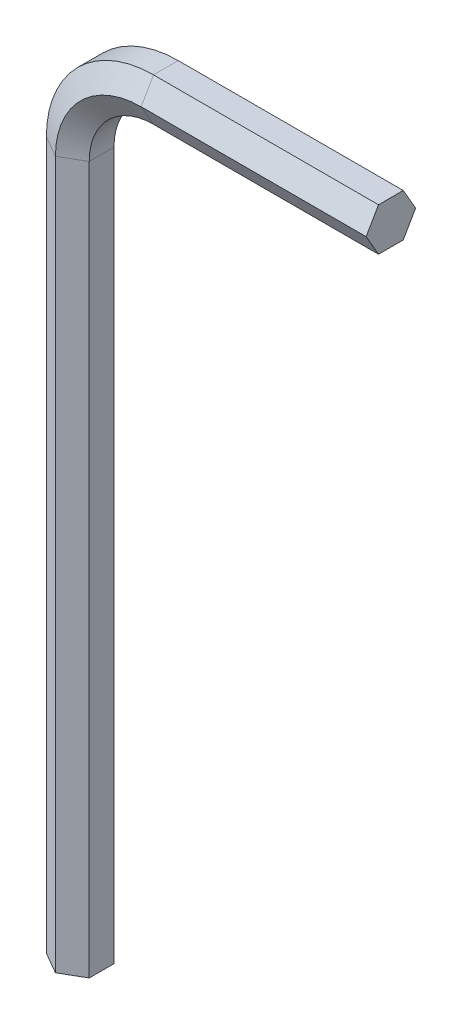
ISO-10303-21;
HEADER;
FILE_DESCRIPTION(('STEP AP214'),'2;1');
FILE_NAME('part.step','',(''),(''),'','','');
FILE_SCHEMA(('AUTOMOTIVE_DESIGN { 1 0 10303 214 1 1 1 1 }'));
ENDSEC;
DATA;
#1=APPLICATION_CONTEXT('core data for automotive mechanical design processes');
#2=APPLICATION_PROTOCOL_DEFINITION('international standard','automotive_design',2000,#1);
#3=PRODUCT_CONTEXT('',#1,'mechanical');
#4=PRODUCT('Part','Part','',(#3));
#5=PRODUCT_RELATED_PRODUCT_CATEGORY('part','',(#4));
#6=PRODUCT_DEFINITION_FORMATION('','',#4);
#7=PRODUCT_DEFINITION_CONTEXT('part definition',#1,'design');
#8=PRODUCT_DEFINITION('design','',#6,#7);
#9=PRODUCT_DEFINITION_SHAPE('','',#8);
#10=(LENGTH_UNIT() NAMED_UNIT(*) SI_UNIT(.MILLI.,.METRE.));
#11=(NAMED_UNIT(*) PLANE_ANGLE_UNIT() SI_UNIT($,.RADIAN.));
#12=(NAMED_UNIT(*) SI_UNIT($,.STERADIAN.) SOLID_ANGLE_UNIT());
#13=UNCERTAINTY_MEASURE_WITH_UNIT(LENGTH_MEASURE(1.E-05),#10,'distance_accuracy_value','');
#14=(GEOMETRIC_REPRESENTATION_CONTEXT(3) GLOBAL_UNCERTAINTY_ASSIGNED_CONTEXT((#13)) GLOBAL_UNIT_ASSIGNED_CONTEXT((#10,
#11,#12)) REPRESENTATION_CONTEXT('',''));
#15=CARTESIAN_POINT('',(0.,0.,0.));
#16=DIRECTION('',(0.,0.,1.));
#17=DIRECTION('',(1.,0.,0.));
#18=AXIS2_PLACEMENT_3D('',#15,#16,#17);
#19=CARTESIAN_POINT('',(0.,0.,0.));
#20=DIRECTION('',(0.,1.,0.));
#21=DIRECTION('',(0.,0.,1.));
#22=AXIS2_PLACEMENT_3D('',#19,#20,#21);
#23=PLANE('',#22);
#24=DIRECTION('',(-0.866025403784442,0.,-0.499999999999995));
#25=VECTOR('',#24,1.);
#26=CARTESIAN_POINT('',(1.99999999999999,0.,-1.15470053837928));
#27=LINE('',#26,#25);
#28=CARTESIAN_POINT('',(1.99999999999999,0.,-1.15470053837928));
#29=VERTEX_POINT('',#28);
#30=CARTESIAN_POINT('',(0.,0.,-2.3094010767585));
#31=VERTEX_POINT('',#30);
#32=EDGE_CURVE('E196',#29,#31,#27,.T.);
#33=ORIENTED_EDGE('',*,*,#32,.F.);
#34=DIRECTION('',(0.,0.,-1.));
#35=VECTOR('',#34,1.);
#36=CARTESIAN_POINT('',(2.00000000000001,0.,1.15470053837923));
#37=LINE('',#36,#35);
#38=CARTESIAN_POINT('',(2.00000000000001,0.,1.15470053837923));
#39=VERTEX_POINT('',#38);
#40=EDGE_CURVE('E238',#39,#29,#37,.T.);
#41=ORIENTED_EDGE('',*,*,#40,.F.);
#42=DIRECTION('',(0.866025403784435,0.,-0.500000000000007));
#43=VECTOR('',#42,1.);
#44=CARTESIAN_POINT('',(0.,0.,2.3094010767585));
#45=LINE('',#44,#43);
#46=CARTESIAN_POINT('',(0.,0.,2.3094010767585));
#47=VERTEX_POINT('',#46);
#48=EDGE_CURVE('E225',#47,#39,#45,.T.);
#49=ORIENTED_EDGE('',*,*,#48,.F.);
#50=DIRECTION('',(0.866025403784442,0.,0.499999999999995));
#51=VECTOR('',#50,1.);
#52=CARTESIAN_POINT('',(-2.,0.,1.15470053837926));
#53=LINE('',#52,#51);
#54=CARTESIAN_POINT('',(-2.,0.,1.15470053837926));
#55=VERTEX_POINT('',#54);
#56=EDGE_CURVE('E148',#55,#47,#53,.T.);
#57=ORIENTED_EDGE('',*,*,#56,.F.);
#58=DIRECTION('',(0.,0.,1.));
#59=VECTOR('',#58,1.);
#60=CARTESIAN_POINT('',(-2.,0.,-1.15470053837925));
#61=LINE('',#60,#59);
#62=CARTESIAN_POINT('',(-2.,0.,-1.15470053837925));
#63=VERTEX_POINT('',#62);
#64=EDGE_CURVE('E152',#63,#55,#61,.T.);
#65=ORIENTED_EDGE('',*,*,#64,.F.);
#66=DIRECTION('',(-0.866025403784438,0.,0.500000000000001));
#67=VECTOR('',#66,1.);
#68=CARTESIAN_POINT('',(0.,0.,-2.3094010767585));
#69=LINE('',#68,#67);
#70=EDGE_CURVE('E157',#31,#63,#69,.T.);
#71=ORIENTED_EDGE('',*,*,#70,.F.);
#72=EDGE_LOOP('',(#33,#41,#49,#57,#65,#71));
#73=FACE_BOUND('',#72,.T.);
#74=ADVANCED_FACE('F47',(#73),#23,.F.);
#75=CARTESIAN_POINT('',(29.,74.,0.));
#76=DIRECTION('',(1.,0.,0.));
#77=DIRECTION('',(0.,0.,1.));
#78=AXIS2_PLACEMENT_3D('',#75,#76,#77);
#79=PLANE('',#78);
#80=DIRECTION('',(0.,0.866025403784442,-0.499999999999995));
#81=VECTOR('',#80,1.);
#82=CARTESIAN_POINT('',(29.,72.,-1.15470053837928));
#83=LINE('',#82,#81);
#84=CARTESIAN_POINT('',(29.,72.,-1.15470053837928));
#85=VERTEX_POINT('',#84);
#86=CARTESIAN_POINT('',(29.,74.,-2.3094010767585));
#87=VERTEX_POINT('',#86);
#88=EDGE_CURVE('E168',#85,#87,#83,.T.);
#89=ORIENTED_EDGE('',*,*,#88,.T.);
#90=DIRECTION('',(0.,0.866025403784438,0.500000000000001));
#91=VECTOR('',#90,1.);
#92=CARTESIAN_POINT('',(29.,74.,-2.3094010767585));
#93=LINE('',#92,#91);
#94=CARTESIAN_POINT('',(29.,76.,-1.15470053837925));
#95=VERTEX_POINT('',#94);
#96=EDGE_CURVE('E171',#87,#95,#93,.T.);
#97=ORIENTED_EDGE('',*,*,#96,.T.);
#98=DIRECTION('',(0.,0.,1.));
#99=VECTOR('',#98,1.);
#100=CARTESIAN_POINT('',(29.,76.,-1.15470053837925));
#101=LINE('',#100,#99);
#102=CARTESIAN_POINT('',(29.,76.,1.15470053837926));
#103=VERTEX_POINT('',#102);
#104=EDGE_CURVE('E211',#95,#103,#101,.T.);
#105=ORIENTED_EDGE('',*,*,#104,.T.);
#106=DIRECTION('',(0.,-0.866025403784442,0.499999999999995));
#107=VECTOR('',#106,1.);
#108=CARTESIAN_POINT('',(29.,76.,1.15470053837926));
#109=LINE('',#108,#107);
#110=CARTESIAN_POINT('',(29.,74.,2.3094010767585));
#111=VERTEX_POINT('',#110);
#112=EDGE_CURVE('E66',#103,#111,#109,.T.);
#113=ORIENTED_EDGE('',*,*,#112,.T.);
#114=DIRECTION('',(0.,-0.866025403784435,-0.500000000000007));
#115=VECTOR('',#114,1.);
#116=CARTESIAN_POINT('',(29.,74.,2.3094010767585));
#117=LINE('',#116,#115);
#118=CARTESIAN_POINT('',(29.,72.,1.15470053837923));
#119=VERTEX_POINT('',#118);
#120=EDGE_CURVE('E60',#111,#119,#117,.T.);
#121=ORIENTED_EDGE('',*,*,#120,.T.);
#122=DIRECTION('',(0.,0.,-1.));
#123=VECTOR('',#122,1.);
#124=CARTESIAN_POINT('',(29.,72.,1.15470053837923));
#125=LINE('',#124,#123);
#126=EDGE_CURVE('E13',#119,#85,#125,.T.);
#127=ORIENTED_EDGE('',*,*,#126,.T.);
#128=EDGE_LOOP('',(#89,#97,#105,#113,#121,#127));
#129=FACE_BOUND('',#128,.T.);
#130=ADVANCED_FACE('F170',(#129),#79,.T.);
#131=CARTESIAN_POINT('',(1.99999999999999,0.,-1.15470053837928));
#132=DIRECTION('',(0.499999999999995,0.,-0.866025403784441));
#133=DIRECTION('',(-0.866025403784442,0.,-0.499999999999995));
#134=AXIS2_PLACEMENT_3D('',#131,#132,#133);
#135=PLANE('',#134);
#136=DIRECTION('',(0.,1.,0.));
#137=VECTOR('',#136,1.);
#138=CARTESIAN_POINT('',(0.,0.,-2.3094010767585));
#139=LINE('',#138,#137);
#140=CARTESIAN_POINT('',(0.,66.,-2.3094010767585));
#141=VERTEX_POINT('',#140);
#142=EDGE_CURVE('E201',#31,#141,#139,.T.);
#143=ORIENTED_EDGE('',*,*,#142,.T.);
#144=DIRECTION('',(-0.866025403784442,0.,-0.499999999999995));
#145=VECTOR('',#144,1.);
#146=CARTESIAN_POINT('',(1.99999999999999,66.,-1.15470053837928));
#147=LINE('',#146,#145);
#148=CARTESIAN_POINT('',(1.99999999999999,66.,-1.15470053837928));
#149=VERTEX_POINT('',#148);
#150=EDGE_CURVE('E270',#149,#141,#147,.T.);
#151=ORIENTED_EDGE('',*,*,#150,.F.);
#152=DIRECTION('',(0.,1.,0.));
#153=VECTOR('',#152,1.);
#154=CARTESIAN_POINT('',(1.99999999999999,0.,-1.15470053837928));
#155=LINE('',#154,#153);
#156=EDGE_CURVE('E252',#29,#149,#155,.T.);
#157=ORIENTED_EDGE('',*,*,#156,.F.);
#158=ORIENTED_EDGE('',*,*,#32,.T.);
#159=EDGE_LOOP('',(#143,#151,#157,#158));
#160=FACE_BOUND('',#159,.T.);
#161=ADVANCED_FACE('F277',(#160),#135,.T.);
#162=CARTESIAN_POINT('',(0.,0.,-2.3094010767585));
#163=DIRECTION('',(-0.500000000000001,0.,-0.866025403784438));
#164=DIRECTION('',(-0.866025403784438,0.,0.500000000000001));
#165=AXIS2_PLACEMENT_3D('',#162,#163,#164);
#166=PLANE('',#165);
#167=DIRECTION('',(0.,1.,0.));
#168=VECTOR('',#167,1.);
#169=CARTESIAN_POINT('',(-2.,0.,-1.15470053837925));
#170=LINE('',#169,#168);
#171=CARTESIAN_POINT('',(-2.,66.,-1.15470053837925));
#172=VERTEX_POINT('',#171);
#173=EDGE_CURVE('E200',#63,#172,#170,.T.);
#174=ORIENTED_EDGE('',*,*,#173,.T.);
#175=DIRECTION('',(-0.866025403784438,0.,0.500000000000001));
#176=VECTOR('',#175,1.);
#177=CARTESIAN_POINT('',(0.,66.,-2.3094010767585));
#178=LINE('',#177,#176);
#179=EDGE_CURVE('E197',#141,#172,#178,.T.);
#180=ORIENTED_EDGE('',*,*,#179,.F.);
#181=ORIENTED_EDGE('',*,*,#142,.F.);
#182=ORIENTED_EDGE('',*,*,#70,.T.);
#183=EDGE_LOOP('',(#174,#180,#181,#182));
#184=FACE_BOUND('',#183,.T.);
#185=ADVANCED_FACE('F280',(#184),#166,.T.);
#186=CARTESIAN_POINT('',(-2.,0.,-1.15470053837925));
#187=DIRECTION('',(-1.,0.,0.));
#188=DIRECTION('',(0.,0.,1.));
#189=AXIS2_PLACEMENT_3D('',#186,#187,#188);
#190=PLANE('',#189);
#191=DIRECTION('',(0.,1.,0.));
#192=VECTOR('',#191,1.);
#193=CARTESIAN_POINT('',(-2.,0.,1.15470053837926));
#194=LINE('',#193,#192);
#195=CARTESIAN_POINT('',(-2.,66.,1.15470053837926));
#196=VERTEX_POINT('',#195);
#197=EDGE_CURVE('E214',#55,#196,#194,.T.);
#198=ORIENTED_EDGE('',*,*,#197,.T.);
#199=DIRECTION('',(0.,0.,1.));
#200=VECTOR('',#199,1.);
#201=CARTESIAN_POINT('',(-2.,66.,-1.15470053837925));
#202=LINE('',#201,#200);
#203=EDGE_CURVE('E204',#172,#196,#202,.T.);
#204=ORIENTED_EDGE('',*,*,#203,.F.);
#205=ORIENTED_EDGE('',*,*,#173,.F.);
#206=ORIENTED_EDGE('',*,*,#64,.T.);
#207=EDGE_LOOP('',(#198,#204,#205,#206));
#208=FACE_BOUND('',#207,.T.);
#209=ADVANCED_FACE('F334',(#208),#190,.T.);
#210=CARTESIAN_POINT('',(-2.,0.,1.15470053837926));
#211=DIRECTION('',(-0.499999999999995,0.,0.866025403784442));
#212=DIRECTION('',(0.866025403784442,0.,0.499999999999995));
#213=AXIS2_PLACEMENT_3D('',#210,#211,#212);
#214=PLANE('',#213);
#215=DIRECTION('',(0.,1.,0.));
#216=VECTOR('',#215,1.);
#217=CARTESIAN_POINT('',(0.,0.,2.3094010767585));
#218=LINE('',#217,#216);
#219=CARTESIAN_POINT('',(0.,66.,2.3094010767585));
#220=VERTEX_POINT('',#219);
#221=EDGE_CURVE('E227',#47,#220,#218,.T.);
#222=ORIENTED_EDGE('',*,*,#221,.T.);
#223=DIRECTION('',(0.866025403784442,0.,0.499999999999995));
#224=VECTOR('',#223,1.);
#225=CARTESIAN_POINT('',(-2.,66.,1.15470053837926));
#226=LINE('',#225,#224);
#227=EDGE_CURVE('E217',#196,#220,#226,.T.);
#228=ORIENTED_EDGE('',*,*,#227,.F.);
#229=ORIENTED_EDGE('',*,*,#197,.F.);
#230=ORIENTED_EDGE('',*,*,#56,.T.);
#231=EDGE_LOOP('',(#222,#228,#229,#230));
#232=FACE_BOUND('',#231,.T.);
#233=ADVANCED_FACE('F342',(#232),#214,.T.);
#234=CARTESIAN_POINT('',(0.,0.,2.3094010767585));
#235=DIRECTION('',(0.500000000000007,0.,0.866025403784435));
#236=DIRECTION('',(0.866025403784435,0.,-0.500000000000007));
#237=AXIS2_PLACEMENT_3D('',#234,#235,#236);
#238=PLANE('',#237);
#239=DIRECTION('',(0.,1.,0.));
#240=VECTOR('',#239,1.);
#241=CARTESIAN_POINT('',(2.00000000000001,0.,1.15470053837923));
#242=LINE('',#241,#240);
#243=CARTESIAN_POINT('',(2.00000000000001,66.,1.15470053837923));
#244=VERTEX_POINT('',#243);
#245=EDGE_CURVE('E240',#39,#244,#242,.T.);
#246=ORIENTED_EDGE('',*,*,#245,.T.);
#247=DIRECTION('',(0.866025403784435,0.,-0.500000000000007));
#248=VECTOR('',#247,1.);
#249=CARTESIAN_POINT('',(0.,66.,2.3094010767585));
#250=LINE('',#249,#248);
#251=EDGE_CURVE('E230',#220,#244,#250,.T.);
#252=ORIENTED_EDGE('',*,*,#251,.F.);
#253=ORIENTED_EDGE('',*,*,#221,.F.);
#254=ORIENTED_EDGE('',*,*,#48,.T.);
#255=EDGE_LOOP('',(#246,#252,#253,#254));
#256=FACE_BOUND('',#255,.T.);
#257=ADVANCED_FACE('F352',(#256),#238,.T.);
#258=CARTESIAN_POINT('',(2.00000000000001,0.,1.15470053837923));
#259=DIRECTION('',(1.,0.,0.));
#260=DIRECTION('',(0.,0.,-1.));
#261=AXIS2_PLACEMENT_3D('',#258,#259,#260);
#262=PLANE('',#261);
#263=DIRECTION('',(0.,0.,-1.));
#264=VECTOR('',#263,1.);
#265=CARTESIAN_POINT('',(2.00000000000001,66.,1.15470053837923));
#266=LINE('',#265,#264);
#267=EDGE_CURVE('E243',#244,#149,#266,.T.);
#268=ORIENTED_EDGE('',*,*,#267,.F.);
#269=ORIENTED_EDGE('',*,*,#245,.F.);
#270=ORIENTED_EDGE('',*,*,#40,.T.);
#271=ORIENTED_EDGE('',*,*,#156,.T.);
#272=EDGE_LOOP('',(#268,#269,#270,#271));
#273=FACE_BOUND('',#272,.T.);
#274=ADVANCED_FACE('F293',(#273),#262,.T.);
#275=CARTESIAN_POINT('',(8.,66.,-1.15470053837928));
#276=DIRECTION('',(0.,0.,-1.));
#277=DIRECTION('',(-1.,0.,0.));
#278=AXIS2_PLACEMENT_3D('',#275,#276,#277);
#279=CONICAL_SURFACE('',#278,6.,1.0471975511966);
#280=CARTESIAN_POINT('',(8.,66.,-2.3094010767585));
#281=DIRECTION('',(0.,0.,-1.));
#282=DIRECTION('',(-1.,0.,0.));
#283=AXIS2_PLACEMENT_3D('',#280,#281,#282);
#284=CIRCLE('',#283,7.99999999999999);
#285=CARTESIAN_POINT('',(8.,74.,-2.3094010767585));
#286=VERTEX_POINT('',#285);
#287=EDGE_CURVE('E207',#141,#286,#284,.T.);
#288=ORIENTED_EDGE('',*,*,#287,.T.);
#289=DIRECTION('',(0.,0.866025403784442,-0.499999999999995));
#290=VECTOR('',#289,1.);
#291=CARTESIAN_POINT('',(8.,72.,-1.15470053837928));
#292=LINE('',#291,#290);
#293=CARTESIAN_POINT('',(8.,72.,-1.15470053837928));
#294=VERTEX_POINT('',#293);
#295=EDGE_CURVE('E189',#294,#286,#292,.T.);
#296=ORIENTED_EDGE('',*,*,#295,.F.);
#297=CARTESIAN_POINT('',(8.,66.,-1.15470053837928));
#298=DIRECTION('',(0.,0.,-1.));
#299=DIRECTION('',(-1.,0.,0.));
#300=AXIS2_PLACEMENT_3D('',#297,#298,#299);
#301=CIRCLE('',#300,6.);
#302=EDGE_CURVE('E254',#149,#294,#301,.T.);
#303=ORIENTED_EDGE('',*,*,#302,.F.);
#304=ORIENTED_EDGE('',*,*,#150,.T.);
#305=EDGE_LOOP('',(#288,#296,#303,#304));
#306=FACE_BOUND('',#305,.T.);
#307=ADVANCED_FACE('F260',(#306),#279,.F.);
#308=CARTESIAN_POINT('',(8.,66.,-2.3094010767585));
#309=DIRECTION('',(0.,0.,1.));
#310=DIRECTION('',(1.,0.,0.));
#311=AXIS2_PLACEMENT_3D('',#308,#309,#310);
#312=CONICAL_SURFACE('',#311,7.99999999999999,1.0471975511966);
#313=CARTESIAN_POINT('',(8.,66.,-1.15470053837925));
#314=DIRECTION('',(0.,0.,-1.));
#315=DIRECTION('',(-1.,0.,0.));
#316=AXIS2_PLACEMENT_3D('',#313,#314,#315);
#317=CIRCLE('',#316,9.99999999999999);
#318=CARTESIAN_POINT('',(8.,76.,-1.15470053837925));
#319=VERTEX_POINT('',#318);
#320=EDGE_CURVE('E135',#172,#319,#317,.T.);
#321=ORIENTED_EDGE('',*,*,#320,.T.);
#322=DIRECTION('',(0.,0.866025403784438,0.500000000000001));
#323=VECTOR('',#322,1.);
#324=CARTESIAN_POINT('',(8.,74.,-2.3094010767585));
#325=LINE('',#324,#323);
#326=EDGE_CURVE('E205',#286,#319,#325,.T.);
#327=ORIENTED_EDGE('',*,*,#326,.F.);
#328=ORIENTED_EDGE('',*,*,#287,.F.);
#329=ORIENTED_EDGE('',*,*,#179,.T.);
#330=EDGE_LOOP('',(#321,#327,#328,#329));
#331=FACE_BOUND('',#330,.T.);
#332=ADVANCED_FACE('F283',(#331),#312,.T.);
#333=CARTESIAN_POINT('',(8.,66.,0.));
#334=DIRECTION('',(0.,0.,-1.));
#335=DIRECTION('',(-1.,0.,0.));
#336=AXIS2_PLACEMENT_3D('',#333,#334,#335);
#337=CYLINDRICAL_SURFACE('',#336,9.99999999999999);
#338=CARTESIAN_POINT('',(8.,66.,1.15470053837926));
#339=DIRECTION('',(0.,0.,-1.));
#340=DIRECTION('',(-1.,0.,0.));
#341=AXIS2_PLACEMENT_3D('',#338,#339,#340);
#342=CIRCLE('',#341,9.99999999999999);
#343=CARTESIAN_POINT('',(8.,76.,1.15470053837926));
#344=VERTEX_POINT('',#343);
#345=EDGE_CURVE('E126',#196,#344,#342,.T.);
#346=ORIENTED_EDGE('',*,*,#345,.T.);
#347=DIRECTION('',(0.,0.,1.));
#348=VECTOR('',#347,1.);
#349=CARTESIAN_POINT('',(8.,76.,-1.15470053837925));
#350=LINE('',#349,#348);
#351=EDGE_CURVE('E208',#319,#344,#350,.T.);
#352=ORIENTED_EDGE('',*,*,#351,.F.);
#353=ORIENTED_EDGE('',*,*,#320,.F.);
#354=ORIENTED_EDGE('',*,*,#203,.T.);
#355=EDGE_LOOP('',(#346,#352,#353,#354));
#356=FACE_BOUND('',#355,.T.);
#357=ADVANCED_FACE('F285',(#356),#337,.T.);
#358=CARTESIAN_POINT('',(8.,66.,1.15470053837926));
#359=DIRECTION('',(0.,0.,-1.));
#360=DIRECTION('',(-1.,0.,0.));
#361=AXIS2_PLACEMENT_3D('',#358,#359,#360);
#362=CONICAL_SURFACE('',#361,9.99999999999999,1.0471975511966);
#363=CARTESIAN_POINT('',(8.,66.,2.3094010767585));
#364=DIRECTION('',(0.,0.,-1.));
#365=DIRECTION('',(-1.,0.,0.));
#366=AXIS2_PLACEMENT_3D('',#363,#364,#365);
#367=CIRCLE('',#366,7.99999999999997);
#368=CARTESIAN_POINT('',(8.,74.,2.3094010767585));
#369=VERTEX_POINT('',#368);
#370=EDGE_CURVE('E119',#220,#369,#367,.T.);
#371=ORIENTED_EDGE('',*,*,#370,.T.);
#372=DIRECTION('',(0.,-0.866025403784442,0.499999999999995));
#373=VECTOR('',#372,1.);
#374=CARTESIAN_POINT('',(8.,76.,1.15470053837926));
#375=LINE('',#374,#373);
#376=EDGE_CURVE('E221',#344,#369,#375,.T.);
#377=ORIENTED_EDGE('',*,*,#376,.F.);
#378=ORIENTED_EDGE('',*,*,#345,.F.);
#379=ORIENTED_EDGE('',*,*,#227,.T.);
#380=EDGE_LOOP('',(#371,#377,#378,#379));
#381=FACE_BOUND('',#380,.T.);
#382=ADVANCED_FACE('F291',(#381),#362,.T.);
#383=CARTESIAN_POINT('',(8.,66.,2.3094010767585));
#384=DIRECTION('',(0.,0.,1.));
#385=DIRECTION('',(1.,0.,0.));
#386=AXIS2_PLACEMENT_3D('',#383,#384,#385);
#387=CONICAL_SURFACE('',#386,7.99999999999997,1.04719755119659);
#388=CARTESIAN_POINT('',(8.,66.,1.15470053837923));
#389=DIRECTION('',(0.,0.,-1.));
#390=DIRECTION('',(-1.,0.,0.));
#391=AXIS2_PLACEMENT_3D('',#388,#389,#390);
#392=CIRCLE('',#391,5.99999999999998);
#393=CARTESIAN_POINT('',(8.,72.,1.15470053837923));
#394=VERTEX_POINT('',#393);
#395=EDGE_CURVE('E245',#244,#394,#392,.T.);
#396=ORIENTED_EDGE('',*,*,#395,.T.);
#397=DIRECTION('',(0.,-0.866025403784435,-0.500000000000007));
#398=VECTOR('',#397,1.);
#399=CARTESIAN_POINT('',(8.,74.,2.3094010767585));
#400=LINE('',#399,#398);
#401=EDGE_CURVE('E233',#369,#394,#400,.T.);
#402=ORIENTED_EDGE('',*,*,#401,.F.);
#403=ORIENTED_EDGE('',*,*,#370,.F.);
#404=ORIENTED_EDGE('',*,*,#251,.T.);
#405=EDGE_LOOP('',(#396,#402,#403,#404));
#406=FACE_BOUND('',#405,.T.);
#407=ADVANCED_FACE('F395',(#406),#387,.F.);
#408=CARTESIAN_POINT('',(8.,66.,0.));
#409=DIRECTION('',(0.,0.,-1.));
#410=DIRECTION('',(-1.,0.,0.));
#411=AXIS2_PLACEMENT_3D('',#408,#409,#410);
#412=CYLINDRICAL_SURFACE('',#411,5.99999999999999);
#413=DIRECTION('',(0.,0.,-1.));
#414=VECTOR('',#413,1.);
#415=CARTESIAN_POINT('',(8.,72.,1.15470053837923));
#416=LINE('',#415,#414);
#417=EDGE_CURVE('E194',#394,#294,#416,.T.);
#418=ORIENTED_EDGE('',*,*,#417,.F.);
#419=ORIENTED_EDGE('',*,*,#395,.F.);
#420=ORIENTED_EDGE('',*,*,#267,.T.);
#421=ORIENTED_EDGE('',*,*,#302,.T.);
#422=EDGE_LOOP('',(#418,#419,#420,#421));
#423=FACE_BOUND('',#422,.T.);
#424=ADVANCED_FACE('F263',(#423),#412,.F.);
#425=CARTESIAN_POINT('',(8.,72.,-1.15470053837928));
#426=DIRECTION('',(0.,-0.499999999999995,-0.866025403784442));
#427=DIRECTION('',(0.,0.866025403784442,-0.499999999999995));
#428=AXIS2_PLACEMENT_3D('',#425,#426,#427);
#429=PLANE('',#428);
#430=DIRECTION('',(1.,0.,0.));
#431=VECTOR('',#430,1.);
#432=CARTESIAN_POINT('',(8.,74.,-2.3094010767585));
#433=LINE('',#432,#431);
#434=EDGE_CURVE('E176',#286,#87,#433,.T.);
#435=ORIENTED_EDGE('',*,*,#434,.T.);
#436=ORIENTED_EDGE('',*,*,#88,.F.);
#437=DIRECTION('',(1.,0.,0.));
#438=VECTOR('',#437,1.);
#439=CARTESIAN_POINT('',(8.,72.,-1.15470053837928));
#440=LINE('',#439,#438);
#441=EDGE_CURVE('E177',#294,#85,#440,.T.);
#442=ORIENTED_EDGE('',*,*,#441,.F.);
#443=ORIENTED_EDGE('',*,*,#295,.T.);
#444=EDGE_LOOP('',(#435,#436,#442,#443));
#445=FACE_BOUND('',#444,.T.);
#446=ADVANCED_FACE('F187',(#445),#429,.T.);
#447=CARTESIAN_POINT('',(8.,74.,-2.3094010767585));
#448=DIRECTION('',(0.,0.500000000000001,-0.866025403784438));
#449=DIRECTION('',(0.,0.866025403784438,0.500000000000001));
#450=AXIS2_PLACEMENT_3D('',#447,#448,#449);
#451=PLANE('',#450);
#452=DIRECTION('',(1.,0.,0.));
#453=VECTOR('',#452,1.);
#454=CARTESIAN_POINT('',(8.,76.,-1.15470053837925));
#455=LINE('',#454,#453);
#456=EDGE_CURVE('E184',#319,#95,#455,.T.);
#457=ORIENTED_EDGE('',*,*,#456,.T.);
#458=ORIENTED_EDGE('',*,*,#96,.F.);
#459=ORIENTED_EDGE('',*,*,#434,.F.);
#460=ORIENTED_EDGE('',*,*,#326,.T.);
#461=EDGE_LOOP('',(#457,#458,#459,#460));
#462=FACE_BOUND('',#461,.T.);
#463=ADVANCED_FACE('F181',(#462),#451,.T.);
#464=CARTESIAN_POINT('',(8.,76.,-1.15470053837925));
#465=DIRECTION('',(0.,1.,0.));
#466=DIRECTION('',(0.,0.,1.));
#467=AXIS2_PLACEMENT_3D('',#464,#465,#466);
#468=PLANE('',#467);
#469=DIRECTION('',(1.,0.,0.));
#470=VECTOR('',#469,1.);
#471=CARTESIAN_POINT('',(8.,76.,1.15470053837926));
#472=LINE('',#471,#470);
#473=EDGE_CURVE('E104',#344,#103,#472,.T.);
#474=ORIENTED_EDGE('',*,*,#473,.T.);
#475=ORIENTED_EDGE('',*,*,#104,.F.);
#476=ORIENTED_EDGE('',*,*,#456,.F.);
#477=ORIENTED_EDGE('',*,*,#351,.T.);
#478=EDGE_LOOP('',(#474,#475,#476,#477));
#479=FACE_BOUND('',#478,.T.);
#480=ADVANCED_FACE('F427',(#479),#468,.T.);
#481=CARTESIAN_POINT('',(8.,76.,1.15470053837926));
#482=DIRECTION('',(0.,0.499999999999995,0.866025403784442));
#483=DIRECTION('',(0.,-0.866025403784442,0.499999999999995));
#484=AXIS2_PLACEMENT_3D('',#481,#482,#483);
#485=PLANE('',#484);
#486=DIRECTION('',(1.,0.,0.));
#487=VECTOR('',#486,1.);
#488=CARTESIAN_POINT('',(8.,74.,2.3094010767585));
#489=LINE('',#488,#487);
#490=EDGE_CURVE('E96',#369,#111,#489,.T.);
#491=ORIENTED_EDGE('',*,*,#490,.T.);
#492=ORIENTED_EDGE('',*,*,#112,.F.);
#493=ORIENTED_EDGE('',*,*,#473,.F.);
#494=ORIENTED_EDGE('',*,*,#376,.T.);
#495=EDGE_LOOP('',(#491,#492,#493,#494));
#496=FACE_BOUND('',#495,.T.);
#497=ADVANCED_FACE('F303',(#496),#485,.T.);
#498=CARTESIAN_POINT('',(8.,74.,2.3094010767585));
#499=DIRECTION('',(0.,-0.500000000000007,0.866025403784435));
#500=DIRECTION('',(0.,-0.866025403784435,-0.500000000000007));
#501=AXIS2_PLACEMENT_3D('',#498,#499,#500);
#502=PLANE('',#501);
#503=DIRECTION('',(1.,0.,0.));
#504=VECTOR('',#503,1.);
#505=CARTESIAN_POINT('',(8.,72.,1.15470053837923));
#506=LINE('',#505,#504);
#507=EDGE_CURVE('E54',#394,#119,#506,.T.);
#508=ORIENTED_EDGE('',*,*,#507,.T.);
#509=ORIENTED_EDGE('',*,*,#120,.F.);
#510=ORIENTED_EDGE('',*,*,#490,.F.);
#511=ORIENTED_EDGE('',*,*,#401,.T.);
#512=EDGE_LOOP('',(#508,#509,#510,#511));
#513=FACE_BOUND('',#512,.T.);
#514=ADVANCED_FACE('F298',(#513),#502,.T.);
#515=CARTESIAN_POINT('',(8.,72.,1.15470053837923));
#516=DIRECTION('',(0.,-1.,0.));
#517=DIRECTION('',(0.,0.,-1.));
#518=AXIS2_PLACEMENT_3D('',#515,#516,#517);
#519=PLANE('',#518);
#520=ORIENTED_EDGE('',*,*,#126,.F.);
#521=ORIENTED_EDGE('',*,*,#507,.F.);
#522=ORIENTED_EDGE('',*,*,#417,.T.);
#523=ORIENTED_EDGE('',*,*,#441,.T.);
#524=EDGE_LOOP('',(#520,#521,#522,#523));
#525=FACE_BOUND('',#524,.T.);
#526=ADVANCED_FACE('F255',(#525),#519,.T.);
#527=CLOSED_SHELL('',(#74,#130,#161,#185,#209,#233,#257,#274,#307,#332,#357,#382,#407,#424,#446,
#463,#480,#497,#514,#526));
#528=MANIFOLD_SOLID_BREP('B2',#527);
#529=ADVANCED_BREP_SHAPE_REPRESENTATION('',(#18,#528),#14);
#530=SHAPE_DEFINITION_REPRESENTATION(#9,#529);
ENDSEC;
END-ISO-10303-21;
